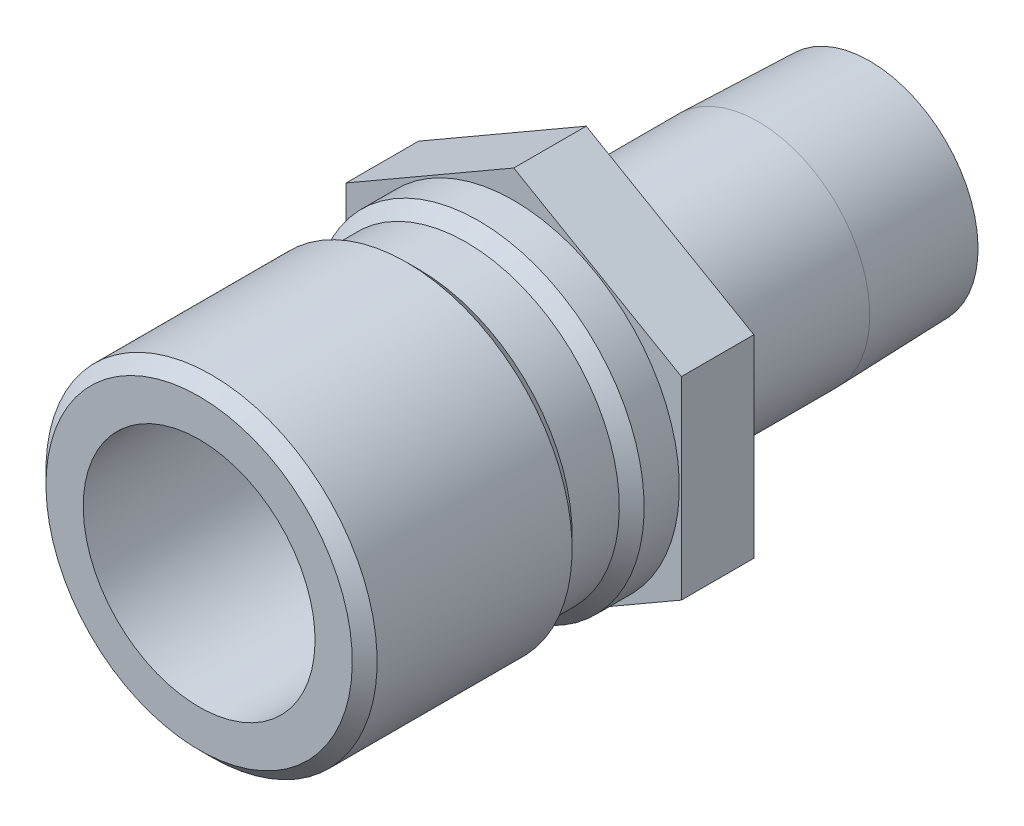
from build123d import *

# Parameters (mm, degrees)
SKETCH2_R           = 4.7625
BOSS_EXTRUDE1_DEPTH = 4.445


with BuildPart() as part:
    # Sketch1 → Revolve1 (revolve)
    with BuildSketch(Plane(origin=(0, 0, 0), x_dir=(0, 0, -1), z_dir=(1, 0, 0))):
        Polygon((-19.304, 7.112), (-19.304, 9.398), (-18.542, 10.16), (-6.5786, 10.16), (-5.8166, 9.398), (-2.921, 9.398), (-2.159, 10.16), (0, 10.16), (0, 6.858), (14.986, 6.858), (21.844, 6.643688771), (21.844, 4.7625), (-0.27474869, 4.7625), (-1.524, 7.112), align=None)
    revolve(axis=Axis((0, 0, 0), (0, 0, 1)))

    # Sketch2 → Boss-Extrude1 (add)
    with BuildSketch(Plane.XY):
        Polygon((-10.287, 5.939202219), (-10.287, -5.939202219), (0, -11.878404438), (10.287, -5.939202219), (10.287, 5.939202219), (0, 11.878404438), align=None)
        with Locations(Location((0, 0, 0), (0, 0, 90))):
            Circle(SKETCH2_R, mode=Mode.SUBTRACT)
    extrude(amount=-BOSS_EXTRUDE1_DEPTH)


solid = part.part
